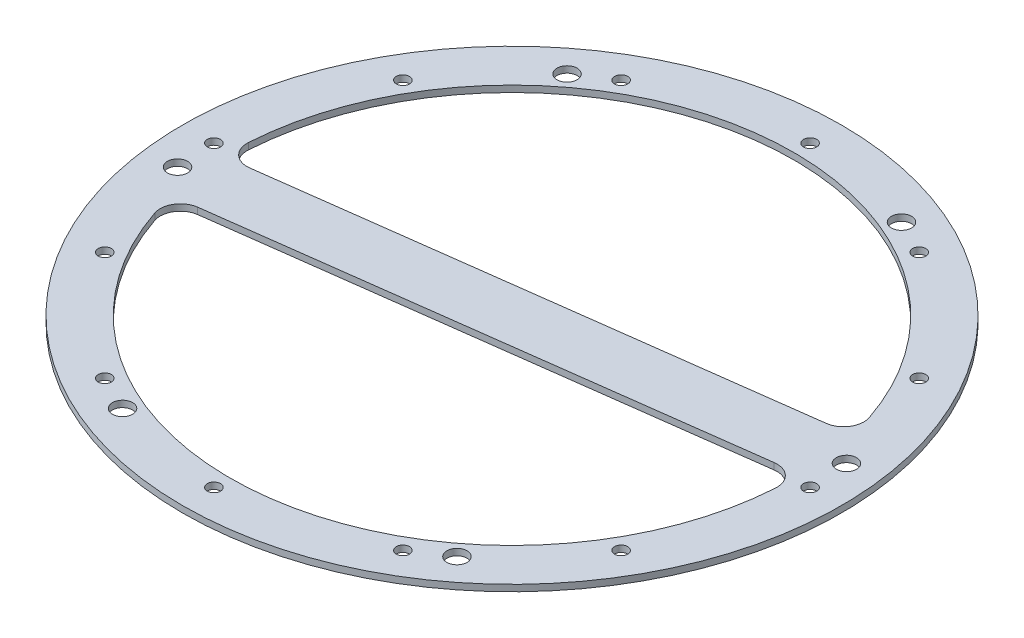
ISO-10303-21;
HEADER;
FILE_DESCRIPTION(('STEP AP214'),'2;1');
FILE_NAME('part.step','',(''),(''),'','','');
FILE_SCHEMA(('AUTOMOTIVE_DESIGN { 1 0 10303 214 1 1 1 1 }'));
ENDSEC;
DATA;
#1=APPLICATION_CONTEXT('core data for automotive mechanical design processes');
#2=APPLICATION_PROTOCOL_DEFINITION('international standard','automotive_design',2000,#1);
#3=PRODUCT_CONTEXT('',#1,'mechanical');
#4=PRODUCT('Part','Part','',(#3));
#5=PRODUCT_RELATED_PRODUCT_CATEGORY('part','',(#4));
#6=PRODUCT_DEFINITION_FORMATION('','',#4);
#7=PRODUCT_DEFINITION_CONTEXT('part definition',#1,'design');
#8=PRODUCT_DEFINITION('design','',#6,#7);
#9=PRODUCT_DEFINITION_SHAPE('','',#8);
#10=(LENGTH_UNIT() NAMED_UNIT(*) SI_UNIT(.MILLI.,.METRE.));
#11=(NAMED_UNIT(*) PLANE_ANGLE_UNIT() SI_UNIT($,.RADIAN.));
#12=(NAMED_UNIT(*) SI_UNIT($,.STERADIAN.) SOLID_ANGLE_UNIT());
#13=UNCERTAINTY_MEASURE_WITH_UNIT(LENGTH_MEASURE(1.E-05),#10,'distance_accuracy_value','');
#14=(GEOMETRIC_REPRESENTATION_CONTEXT(3) GLOBAL_UNCERTAINTY_ASSIGNED_CONTEXT((#13)) GLOBAL_UNIT_ASSIGNED_CONTEXT((#10,
#11,#12)) REPRESENTATION_CONTEXT('',''));
#15=CARTESIAN_POINT('',(0.,0.,0.));
#16=DIRECTION('',(0.,0.,1.));
#17=DIRECTION('',(1.,0.,0.));
#18=AXIS2_PLACEMENT_3D('',#15,#16,#17);
#19=CARTESIAN_POINT('',(0.,1.6,0.));
#20=DIRECTION('',(0.,1.,0.));
#21=DIRECTION('',(0.,0.,1.));
#22=AXIS2_PLACEMENT_3D('',#19,#20,#21);
#23=PLANE('',#22);
#24=CARTESIAN_POINT('',(73.2677752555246,1.6,-9.64588560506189));
#25=DIRECTION('',(0.,1.,0.));
#26=DIRECTION('',(0.,0.,1.));
#27=AXIS2_PLACEMENT_3D('',#24,#25,#26);
#28=CIRCLE('',#27,2.5);
#29=CARTESIAN_POINT('',(73.2677752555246,1.6,-7.14588560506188));
#30=VERTEX_POINT('',#29);
#31=EDGE_CURVE('E569',#30,#30,#28,.T.);
#32=ORIENTED_EDGE('',*,*,#31,.F.);
#33=EDGE_LOOP('',(#32));
#34=FACE_BOUND('',#33,.T.);
#35=CARTESIAN_POINT('',(44.9874696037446,1.6,58.6288118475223));
#36=DIRECTION('',(0.,1.,0.));
#37=DIRECTION('',(0.,0.,1.));
#38=AXIS2_PLACEMENT_3D('',#35,#36,#37);
#39=CIRCLE('',#38,2.5);
#40=CARTESIAN_POINT('',(44.9874696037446,1.6,61.1288118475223));
#41=VERTEX_POINT('',#40);
#42=EDGE_CURVE('E564',#41,#41,#39,.T.);
#43=ORIENTED_EDGE('',*,*,#42,.F.);
#44=EDGE_LOOP('',(#43));
#45=FACE_BOUND('',#44,.T.);
#46=CARTESIAN_POINT('',(-28.28030565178,1.6,68.2746974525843));
#47=DIRECTION('',(0.,1.,0.));
#48=DIRECTION('',(0.,0.,1.));
#49=AXIS2_PLACEMENT_3D('',#46,#47,#48);
#50=CIRCLE('',#49,2.5);
#51=CARTESIAN_POINT('',(-28.28030565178,1.6,70.7746974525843));
#52=VERTEX_POINT('',#51);
#53=EDGE_CURVE('E558',#52,#52,#50,.T.);
#54=ORIENTED_EDGE('',*,*,#53,.F.);
#55=EDGE_LOOP('',(#54));
#56=FACE_BOUND('',#55,.T.);
#57=CARTESIAN_POINT('',(-73.2677752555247,1.6,9.64588560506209));
#58=DIRECTION('',(0.,1.,0.));
#59=DIRECTION('',(0.,0.,1.));
#60=AXIS2_PLACEMENT_3D('',#57,#58,#59);
#61=CIRCLE('',#60,2.5);
#62=CARTESIAN_POINT('',(-73.2677752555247,1.6,12.1458856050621));
#63=VERTEX_POINT('',#62);
#64=EDGE_CURVE('E552',#63,#63,#61,.T.);
#65=ORIENTED_EDGE('',*,*,#64,.F.);
#66=EDGE_LOOP('',(#65));
#67=FACE_BOUND('',#66,.T.);
#68=CARTESIAN_POINT('',(-44.9874696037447,1.6,-58.6288118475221));
#69=DIRECTION('',(0.,1.,0.));
#70=DIRECTION('',(0.,0.,1.));
#71=AXIS2_PLACEMENT_3D('',#68,#69,#70);
#72=CIRCLE('',#71,2.5);
#73=CARTESIAN_POINT('',(-44.9874696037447,1.6,-56.1288118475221));
#74=VERTEX_POINT('',#73);
#75=EDGE_CURVE('E546',#74,#74,#72,.T.);
#76=ORIENTED_EDGE('',*,*,#75,.F.);
#77=EDGE_LOOP('',(#76));
#78=FACE_BOUND('',#77,.T.);
#79=CARTESIAN_POINT('',(28.28030565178,1.6,-68.2746974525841));
#80=DIRECTION('',(0.,1.,0.));
#81=DIRECTION('',(0.,0.,1.));
#82=AXIS2_PLACEMENT_3D('',#79,#80,#81);
#83=CIRCLE('',#82,2.5);
#84=CARTESIAN_POINT('',(28.28030565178,1.6,-65.7746974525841));
#85=VERTEX_POINT('',#84);
#86=EDGE_CURVE('E540',#85,#85,#83,.T.);
#87=ORIENTED_EDGE('',*,*,#86,.F.);
#88=EDGE_LOOP('',(#87));
#89=FACE_BOUND('',#88,.T.);
#90=CARTESIAN_POINT('',(73.9,1.6,0.));
#91=DIRECTION('',(0.,1.,0.));
#92=DIRECTION('',(0.,0.,1.));
#93=AXIS2_PLACEMENT_3D('',#90,#91,#92);
#94=CIRCLE('',#93,1.63194999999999);
#95=CARTESIAN_POINT('',(73.9,1.6,1.63194999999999));
#96=VERTEX_POINT('',#95);
#97=EDGE_CURVE('E534',#96,#96,#94,.T.);
#98=ORIENTED_EDGE('',*,*,#97,.F.);
#99=EDGE_LOOP('',(#98));
#100=FACE_BOUND('',#99,.T.);
#101=CARTESIAN_POINT('',(63.99927733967,1.6,36.95));
#102=DIRECTION('',(0.,1.,0.));
#103=DIRECTION('',(0.,0.,1.));
#104=AXIS2_PLACEMENT_3D('',#101,#102,#103);
#105=CIRCLE('',#104,1.63194999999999);
#106=CARTESIAN_POINT('',(63.99927733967,1.6,38.58195));
#107=VERTEX_POINT('',#106);
#108=EDGE_CURVE('E528',#107,#107,#105,.T.);
#109=ORIENTED_EDGE('',*,*,#108,.F.);
#110=EDGE_LOOP('',(#109));
#111=FACE_BOUND('',#110,.T.);
#112=CARTESIAN_POINT('',(36.9499999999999,1.6,63.9992773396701));
#113=DIRECTION('',(0.,1.,0.));
#114=DIRECTION('',(0.,0.,1.));
#115=AXIS2_PLACEMENT_3D('',#112,#113,#114);
#116=CIRCLE('',#115,1.63194999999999);
#117=CARTESIAN_POINT('',(36.9499999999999,1.6,65.6312273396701));
#118=VERTEX_POINT('',#117);
#119=EDGE_CURVE('E522',#118,#118,#116,.T.);
#120=ORIENTED_EDGE('',*,*,#119,.F.);
#121=EDGE_LOOP('',(#120));
#122=FACE_BOUND('',#121,.T.);
#123=CARTESIAN_POINT('',(-2.58020470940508E-13,1.6,73.9));
#124=DIRECTION('',(0.,1.,0.));
#125=DIRECTION('',(0.,0.,1.));
#126=AXIS2_PLACEMENT_3D('',#123,#124,#125);
#127=CIRCLE('',#126,1.63195);
#128=CARTESIAN_POINT('',(-2.58020470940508E-13,1.6,75.53195));
#129=VERTEX_POINT('',#128);
#130=EDGE_CURVE('E516',#129,#129,#127,.T.);
#131=ORIENTED_EDGE('',*,*,#130,.F.);
#132=EDGE_LOOP('',(#131));
#133=FACE_BOUND('',#132,.T.);
#134=CARTESIAN_POINT('',(-36.9500000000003,1.6,63.9992773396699));
#135=DIRECTION('',(0.,1.,0.));
#136=DIRECTION('',(0.,0.,1.));
#137=AXIS2_PLACEMENT_3D('',#134,#135,#136);
#138=CIRCLE('',#137,1.63195);
#139=CARTESIAN_POINT('',(-36.9500000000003,1.6,65.6312273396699));
#140=VERTEX_POINT('',#139);
#141=EDGE_CURVE('E510',#140,#140,#138,.T.);
#142=ORIENTED_EDGE('',*,*,#141,.F.);
#143=EDGE_LOOP('',(#142));
#144=FACE_BOUND('',#143,.T.);
#145=CARTESIAN_POINT('',(-63.9992773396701,1.6,36.95));
#146=DIRECTION('',(0.,1.,0.));
#147=DIRECTION('',(0.,0.,1.));
#148=AXIS2_PLACEMENT_3D('',#145,#146,#147);
#149=CIRCLE('',#148,1.63194999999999);
#150=CARTESIAN_POINT('',(-63.9992773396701,1.6,38.58195));
#151=VERTEX_POINT('',#150);
#152=EDGE_CURVE('E504',#151,#151,#149,.T.);
#153=ORIENTED_EDGE('',*,*,#152,.F.);
#154=EDGE_LOOP('',(#153));
#155=FACE_BOUND('',#154,.T.);
#156=CARTESIAN_POINT('',(-73.9,1.6,-5.16040941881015E-13));
#157=DIRECTION('',(0.,1.,0.));
#158=DIRECTION('',(0.,0.,1.));
#159=AXIS2_PLACEMENT_3D('',#156,#157,#158);
#160=CIRCLE('',#159,1.63194999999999);
#161=CARTESIAN_POINT('',(-73.9,1.6,1.63194999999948));
#162=VERTEX_POINT('',#161);
#163=EDGE_CURVE('E498',#162,#162,#160,.T.);
#164=ORIENTED_EDGE('',*,*,#163,.F.);
#165=EDGE_LOOP('',(#164));
#166=FACE_BOUND('',#165,.T.);
#167=CARTESIAN_POINT('',(-63.9992773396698,1.6,-36.9500000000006));
#168=DIRECTION('',(0.,1.,0.));
#169=DIRECTION('',(0.,0.,1.));
#170=AXIS2_PLACEMENT_3D('',#167,#168,#169);
#171=CIRCLE('',#170,1.63194999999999);
#172=CARTESIAN_POINT('',(-63.9992773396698,1.6,-35.3180500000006));
#173=VERTEX_POINT('',#172);
#174=EDGE_CURVE('E492',#173,#173,#171,.T.);
#175=ORIENTED_EDGE('',*,*,#174,.F.);
#176=EDGE_LOOP('',(#175));
#177=FACE_BOUND('',#176,.T.);
#178=CARTESIAN_POINT('',(-36.9499999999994,1.6,-63.9992773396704));
#179=DIRECTION('',(0.,1.,0.));
#180=DIRECTION('',(0.,0.,1.));
#181=AXIS2_PLACEMENT_3D('',#178,#179,#180);
#182=CIRCLE('',#181,1.63195);
#183=CARTESIAN_POINT('',(-36.9499999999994,1.6,-62.3673273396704));
#184=VERTEX_POINT('',#183);
#185=EDGE_CURVE('E486',#184,#184,#182,.T.);
#186=ORIENTED_EDGE('',*,*,#185,.F.);
#187=EDGE_LOOP('',(#186));
#188=FACE_BOUND('',#187,.T.);
#189=CARTESIAN_POINT('',(7.74061412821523E-13,1.6,-73.9));
#190=DIRECTION('',(0.,1.,0.));
#191=DIRECTION('',(0.,0.,1.));
#192=AXIS2_PLACEMENT_3D('',#189,#190,#191);
#193=CIRCLE('',#192,1.63195);
#194=CARTESIAN_POINT('',(7.74061412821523E-13,1.6,-72.26805));
#195=VERTEX_POINT('',#194);
#196=EDGE_CURVE('E480',#195,#195,#193,.T.);
#197=ORIENTED_EDGE('',*,*,#196,.F.);
#198=EDGE_LOOP('',(#197));
#199=FACE_BOUND('',#198,.T.);
#200=CARTESIAN_POINT('',(36.9500000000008,1.6,-63.9992773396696));
#201=DIRECTION('',(0.,1.,0.));
#202=DIRECTION('',(0.,0.,1.));
#203=AXIS2_PLACEMENT_3D('',#200,#201,#202);
#204=CIRCLE('',#203,1.63195);
#205=CARTESIAN_POINT('',(36.9500000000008,1.6,-62.3673273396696));
#206=VERTEX_POINT('',#205);
#207=EDGE_CURVE('E472',#206,#206,#204,.T.);
#208=ORIENTED_EDGE('',*,*,#207,.F.);
#209=EDGE_LOOP('',(#208));
#210=FACE_BOUND('',#209,.T.);
#211=CARTESIAN_POINT('',(63.99927733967,1.6,-36.95));
#212=DIRECTION('',(0.,1.,0.));
#213=DIRECTION('',(0.,0.,1.));
#214=AXIS2_PLACEMENT_3D('',#211,#212,#213);
#215=CIRCLE('',#214,1.63194999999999);
#216=CARTESIAN_POINT('',(63.99927733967,1.6,-35.31805));
#217=VERTEX_POINT('',#216);
#218=EDGE_CURVE('E467',#217,#217,#215,.T.);
#219=ORIENTED_EDGE('',*,*,#218,.F.);
#220=EDGE_LOOP('',(#219));
#221=FACE_BOUND('',#220,.T.);
#222=CARTESIAN_POINT('',(0.,1.6,0.));
#223=DIRECTION('',(0.,1.,0.));
#224=DIRECTION('',(0.,0.,1.));
#225=AXIS2_PLACEMENT_3D('',#222,#223,#224);
#226=CIRCLE('',#225,81.7);
#227=CARTESIAN_POINT('',(0.,1.6,81.7));
#228=VERTEX_POINT('',#227);
#229=EDGE_CURVE('E121',#228,#228,#226,.T.);
#230=ORIENTED_EDGE('',*,*,#229,.T.);
#231=EDGE_LOOP('',(#230));
#232=FACE_BOUND('',#231,.T.);
#233=DIRECTION('',(0.99144486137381,0.,-0.130526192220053));
#234=VECTOR('',#233,1.);
#235=CARTESIAN_POINT('',(-69.8808691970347,1.6,1.63527375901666));
#236=LINE('',#235,#234);
#237=CARTESIAN_POINT('',(-64.11896279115,1.6,0.876704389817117));
#238=VERTEX_POINT('',#237);
#239=CARTESIAN_POINT('',(62.1610699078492,1.6,-15.7483773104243));
#240=VERTEX_POINT('',#239);
#241=EDGE_CURVE('E180',#238,#240,#236,.T.);
#242=ORIENTED_EDGE('',*,*,#241,.F.);
#243=CARTESIAN_POINT('',(-64.7715937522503,1.6,-4.08051991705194));
#244=DIRECTION('',(0.,1.,0.));
#245=DIRECTION('',(0.,0.,1.));
#246=AXIS2_PLACEMENT_3D('',#243,#244,#245);
#247=CIRCLE('',#246,5.);
#248=CARTESIAN_POINT('',(-69.7617011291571,1.6,-4.39488971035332));
#249=VERTEX_POINT('',#248);
#250=EDGE_CURVE('E11',#238,#249,#247,.F.);
#251=ORIENTED_EDGE('',*,*,#250,.T.);
#252=CARTESIAN_POINT('',(0.,1.6,0.));
#253=DIRECTION('',(0.,1.,0.));
#254=DIRECTION('',(0.,0.,-1.));
#255=AXIS2_PLACEMENT_3D('',#252,#253,#254);
#256=CIRCLE('',#255,69.9);
#257=CARTESIAN_POINT('',(66.2471476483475,1.6,-22.3007943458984));
#258=VERTEX_POINT('',#257);
#259=EDGE_CURVE('E118',#258,#249,#256,.T.);
#260=ORIENTED_EDGE('',*,*,#259,.F.);
#261=CARTESIAN_POINT('',(61.5084389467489,1.6,-20.7056016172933));
#262=DIRECTION('',(0.,1.,0.));
#263=DIRECTION('',(0.,0.,1.));
#264=AXIS2_PLACEMENT_3D('',#261,#262,#263);
#265=CIRCLE('',#264,5.);
#266=EDGE_CURVE('E144',#258,#240,#265,.F.);
#267=ORIENTED_EDGE('',*,*,#266,.T.);
#268=EDGE_LOOP('',(#242,#251,#260,#267));
#269=FACE_BOUND('',#268,.T.);
#270=DIRECTION('',(-0.99144486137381,0.,0.130526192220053));
#271=VECTOR('',#270,1.);
#272=CARTESIAN_POINT('',(-67.9229763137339,1.6,16.5069466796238));
#273=LINE('',#272,#271);
#274=CARTESIAN_POINT('',(64.11896279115,1.6,-0.876704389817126));
#275=VERTEX_POINT('',#274);
#276=CARTESIAN_POINT('',(-62.1610699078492,1.6,15.7483773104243));
#277=VERTEX_POINT('',#276);
#278=EDGE_CURVE('E169',#275,#277,#273,.T.);
#279=ORIENTED_EDGE('',*,*,#278,.F.);
#280=CARTESIAN_POINT('',(64.7715937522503,1.6,4.08051991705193));
#281=DIRECTION('',(0.,1.,0.));
#282=DIRECTION('',(0.,0.,1.));
#283=AXIS2_PLACEMENT_3D('',#280,#281,#282);
#284=CIRCLE('',#283,5.);
#285=CARTESIAN_POINT('',(69.7617011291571,1.6,4.39488971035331));
#286=VERTEX_POINT('',#285);
#287=EDGE_CURVE('E148',#275,#286,#284,.F.);
#288=ORIENTED_EDGE('',*,*,#287,.T.);
#289=CARTESIAN_POINT('',(0.,1.6,0.));
#290=DIRECTION('',(0.,1.,0.));
#291=DIRECTION('',(0.,0.,1.));
#292=AXIS2_PLACEMENT_3D('',#289,#290,#291);
#293=CIRCLE('',#292,69.9);
#294=CARTESIAN_POINT('',(-66.2471476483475,1.6,22.3007943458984));
#295=VERTEX_POINT('',#294);
#296=EDGE_CURVE('E171',#295,#286,#293,.T.);
#297=ORIENTED_EDGE('',*,*,#296,.F.);
#298=CARTESIAN_POINT('',(-61.508438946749,1.6,20.7056016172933));
#299=DIRECTION('',(0.,1.,0.));
#300=DIRECTION('',(0.,0.,1.));
#301=AXIS2_PLACEMENT_3D('',#298,#299,#300);
#302=CIRCLE('',#301,5.);
#303=EDGE_CURVE('E49',#295,#277,#302,.F.);
#304=ORIENTED_EDGE('',*,*,#303,.T.);
#305=EDGE_LOOP('',(#279,#288,#297,#304));
#306=FACE_BOUND('',#305,.T.);
#307=ADVANCED_FACE('F34',(#34,#45,#56,#67,#78,#89,#100,#111,#122,#133,#144,#155,#166,#177,#188,
#199,#210,#221,#232,#269,#306),#23,.T.);
#308=CARTESIAN_POINT('',(0.,0.,0.));
#309=DIRECTION('',(0.,1.,0.));
#310=DIRECTION('',(0.,0.,1.));
#311=AXIS2_PLACEMENT_3D('',#308,#309,#310);
#312=PLANE('',#311);
#313=CARTESIAN_POINT('',(73.2677752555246,0.,-9.64588560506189));
#314=DIRECTION('',(0.,1.,0.));
#315=DIRECTION('',(0.,0.,1.));
#316=AXIS2_PLACEMENT_3D('',#313,#314,#315);
#317=CIRCLE('',#316,2.5);
#318=CARTESIAN_POINT('',(73.2677752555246,0.,-7.14588560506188));
#319=VERTEX_POINT('',#318);
#320=EDGE_CURVE('E567',#319,#319,#317,.T.);
#321=ORIENTED_EDGE('',*,*,#320,.T.);
#322=EDGE_LOOP('',(#321));
#323=FACE_BOUND('',#322,.T.);
#324=CARTESIAN_POINT('',(44.9874696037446,0.,58.6288118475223));
#325=DIRECTION('',(0.,1.,0.));
#326=DIRECTION('',(0.,0.,1.));
#327=AXIS2_PLACEMENT_3D('',#324,#325,#326);
#328=CIRCLE('',#327,2.5);
#329=CARTESIAN_POINT('',(44.9874696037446,0.,61.1288118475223));
#330=VERTEX_POINT('',#329);
#331=EDGE_CURVE('E561',#330,#330,#328,.T.);
#332=ORIENTED_EDGE('',*,*,#331,.T.);
#333=EDGE_LOOP('',(#332));
#334=FACE_BOUND('',#333,.T.);
#335=CARTESIAN_POINT('',(-28.28030565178,0.,68.2746974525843));
#336=DIRECTION('',(0.,1.,0.));
#337=DIRECTION('',(0.,0.,1.));
#338=AXIS2_PLACEMENT_3D('',#335,#336,#337);
#339=CIRCLE('',#338,2.5);
#340=CARTESIAN_POINT('',(-28.28030565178,0.,70.7746974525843));
#341=VERTEX_POINT('',#340);
#342=EDGE_CURVE('E555',#341,#341,#339,.T.);
#343=ORIENTED_EDGE('',*,*,#342,.T.);
#344=EDGE_LOOP('',(#343));
#345=FACE_BOUND('',#344,.T.);
#346=CARTESIAN_POINT('',(-73.2677752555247,0.,9.64588560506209));
#347=DIRECTION('',(0.,1.,0.));
#348=DIRECTION('',(0.,0.,1.));
#349=AXIS2_PLACEMENT_3D('',#346,#347,#348);
#350=CIRCLE('',#349,2.5);
#351=CARTESIAN_POINT('',(-73.2677752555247,0.,12.1458856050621));
#352=VERTEX_POINT('',#351);
#353=EDGE_CURVE('E549',#352,#352,#350,.T.);
#354=ORIENTED_EDGE('',*,*,#353,.T.);
#355=EDGE_LOOP('',(#354));
#356=FACE_BOUND('',#355,.T.);
#357=CARTESIAN_POINT('',(-44.9874696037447,0.,-58.6288118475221));
#358=DIRECTION('',(0.,1.,0.));
#359=DIRECTION('',(0.,0.,1.));
#360=AXIS2_PLACEMENT_3D('',#357,#358,#359);
#361=CIRCLE('',#360,2.5);
#362=CARTESIAN_POINT('',(-44.9874696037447,0.,-56.1288118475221));
#363=VERTEX_POINT('',#362);
#364=EDGE_CURVE('E543',#363,#363,#361,.T.);
#365=ORIENTED_EDGE('',*,*,#364,.T.);
#366=EDGE_LOOP('',(#365));
#367=FACE_BOUND('',#366,.T.);
#368=CARTESIAN_POINT('',(28.28030565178,0.,-68.2746974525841));
#369=DIRECTION('',(0.,1.,0.));
#370=DIRECTION('',(0.,0.,1.));
#371=AXIS2_PLACEMENT_3D('',#368,#369,#370);
#372=CIRCLE('',#371,2.5);
#373=CARTESIAN_POINT('',(28.28030565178,0.,-65.7746974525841));
#374=VERTEX_POINT('',#373);
#375=EDGE_CURVE('E537',#374,#374,#372,.T.);
#376=ORIENTED_EDGE('',*,*,#375,.T.);
#377=EDGE_LOOP('',(#376));
#378=FACE_BOUND('',#377,.T.);
#379=CARTESIAN_POINT('',(73.9,0.,0.));
#380=DIRECTION('',(0.,1.,0.));
#381=DIRECTION('',(0.,0.,1.));
#382=AXIS2_PLACEMENT_3D('',#379,#380,#381);
#383=CIRCLE('',#382,1.63194999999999);
#384=CARTESIAN_POINT('',(73.9,0.,1.63194999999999));
#385=VERTEX_POINT('',#384);
#386=EDGE_CURVE('E531',#385,#385,#383,.T.);
#387=ORIENTED_EDGE('',*,*,#386,.T.);
#388=EDGE_LOOP('',(#387));
#389=FACE_BOUND('',#388,.T.);
#390=CARTESIAN_POINT('',(63.99927733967,0.,36.95));
#391=DIRECTION('',(0.,1.,0.));
#392=DIRECTION('',(0.,0.,1.));
#393=AXIS2_PLACEMENT_3D('',#390,#391,#392);
#394=CIRCLE('',#393,1.63194999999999);
#395=CARTESIAN_POINT('',(63.99927733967,0.,38.58195));
#396=VERTEX_POINT('',#395);
#397=EDGE_CURVE('E525',#396,#396,#394,.T.);
#398=ORIENTED_EDGE('',*,*,#397,.T.);
#399=EDGE_LOOP('',(#398));
#400=FACE_BOUND('',#399,.T.);
#401=CARTESIAN_POINT('',(36.9499999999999,0.,63.9992773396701));
#402=DIRECTION('',(0.,1.,0.));
#403=DIRECTION('',(0.,0.,1.));
#404=AXIS2_PLACEMENT_3D('',#401,#402,#403);
#405=CIRCLE('',#404,1.63194999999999);
#406=CARTESIAN_POINT('',(36.9499999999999,0.,65.6312273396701));
#407=VERTEX_POINT('',#406);
#408=EDGE_CURVE('E519',#407,#407,#405,.T.);
#409=ORIENTED_EDGE('',*,*,#408,.T.);
#410=EDGE_LOOP('',(#409));
#411=FACE_BOUND('',#410,.T.);
#412=CARTESIAN_POINT('',(-2.58020470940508E-13,0.,73.9));
#413=DIRECTION('',(0.,1.,0.));
#414=DIRECTION('',(0.,0.,1.));
#415=AXIS2_PLACEMENT_3D('',#412,#413,#414);
#416=CIRCLE('',#415,1.63195);
#417=CARTESIAN_POINT('',(-2.58020470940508E-13,0.,75.53195));
#418=VERTEX_POINT('',#417);
#419=EDGE_CURVE('E513',#418,#418,#416,.T.);
#420=ORIENTED_EDGE('',*,*,#419,.T.);
#421=EDGE_LOOP('',(#420));
#422=FACE_BOUND('',#421,.T.);
#423=CARTESIAN_POINT('',(-36.9500000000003,0.,63.9992773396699));
#424=DIRECTION('',(0.,1.,0.));
#425=DIRECTION('',(0.,0.,1.));
#426=AXIS2_PLACEMENT_3D('',#423,#424,#425);
#427=CIRCLE('',#426,1.63195);
#428=CARTESIAN_POINT('',(-36.9500000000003,0.,65.6312273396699));
#429=VERTEX_POINT('',#428);
#430=EDGE_CURVE('E507',#429,#429,#427,.T.);
#431=ORIENTED_EDGE('',*,*,#430,.T.);
#432=EDGE_LOOP('',(#431));
#433=FACE_BOUND('',#432,.T.);
#434=CARTESIAN_POINT('',(-63.9992773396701,0.,36.95));
#435=DIRECTION('',(0.,1.,0.));
#436=DIRECTION('',(0.,0.,1.));
#437=AXIS2_PLACEMENT_3D('',#434,#435,#436);
#438=CIRCLE('',#437,1.63194999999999);
#439=CARTESIAN_POINT('',(-63.9992773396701,0.,38.58195));
#440=VERTEX_POINT('',#439);
#441=EDGE_CURVE('E501',#440,#440,#438,.T.);
#442=ORIENTED_EDGE('',*,*,#441,.T.);
#443=EDGE_LOOP('',(#442));
#444=FACE_BOUND('',#443,.T.);
#445=CARTESIAN_POINT('',(-73.9,0.,-5.16040941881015E-13));
#446=DIRECTION('',(0.,1.,0.));
#447=DIRECTION('',(0.,0.,1.));
#448=AXIS2_PLACEMENT_3D('',#445,#446,#447);
#449=CIRCLE('',#448,1.63194999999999);
#450=CARTESIAN_POINT('',(-73.9,0.,1.63194999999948));
#451=VERTEX_POINT('',#450);
#452=EDGE_CURVE('E495',#451,#451,#449,.T.);
#453=ORIENTED_EDGE('',*,*,#452,.T.);
#454=EDGE_LOOP('',(#453));
#455=FACE_BOUND('',#454,.T.);
#456=CARTESIAN_POINT('',(-63.9992773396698,0.,-36.9500000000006));
#457=DIRECTION('',(0.,1.,0.));
#458=DIRECTION('',(0.,0.,1.));
#459=AXIS2_PLACEMENT_3D('',#456,#457,#458);
#460=CIRCLE('',#459,1.63194999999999);
#461=CARTESIAN_POINT('',(-63.9992773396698,0.,-35.3180500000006));
#462=VERTEX_POINT('',#461);
#463=EDGE_CURVE('E489',#462,#462,#460,.T.);
#464=ORIENTED_EDGE('',*,*,#463,.T.);
#465=EDGE_LOOP('',(#464));
#466=FACE_BOUND('',#465,.T.);
#467=CARTESIAN_POINT('',(-36.9499999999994,0.,-63.9992773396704));
#468=DIRECTION('',(0.,1.,0.));
#469=DIRECTION('',(0.,0.,1.));
#470=AXIS2_PLACEMENT_3D('',#467,#468,#469);
#471=CIRCLE('',#470,1.63195);
#472=CARTESIAN_POINT('',(-36.9499999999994,0.,-62.3673273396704));
#473=VERTEX_POINT('',#472);
#474=EDGE_CURVE('E483',#473,#473,#471,.T.);
#475=ORIENTED_EDGE('',*,*,#474,.T.);
#476=EDGE_LOOP('',(#475));
#477=FACE_BOUND('',#476,.T.);
#478=CARTESIAN_POINT('',(7.74061412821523E-13,0.,-73.9));
#479=DIRECTION('',(0.,1.,0.));
#480=DIRECTION('',(0.,0.,1.));
#481=AXIS2_PLACEMENT_3D('',#478,#479,#480);
#482=CIRCLE('',#481,1.63195);
#483=CARTESIAN_POINT('',(7.74061412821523E-13,0.,-72.26805));
#484=VERTEX_POINT('',#483);
#485=EDGE_CURVE('E477',#484,#484,#482,.T.);
#486=ORIENTED_EDGE('',*,*,#485,.T.);
#487=EDGE_LOOP('',(#486));
#488=FACE_BOUND('',#487,.T.);
#489=CARTESIAN_POINT('',(36.9500000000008,0.,-63.9992773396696));
#490=DIRECTION('',(0.,1.,0.));
#491=DIRECTION('',(0.,0.,1.));
#492=AXIS2_PLACEMENT_3D('',#489,#490,#491);
#493=CIRCLE('',#492,1.63195);
#494=CARTESIAN_POINT('',(36.9500000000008,0.,-62.3673273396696));
#495=VERTEX_POINT('',#494);
#496=EDGE_CURVE('E469',#495,#495,#493,.T.);
#497=ORIENTED_EDGE('',*,*,#496,.T.);
#498=EDGE_LOOP('',(#497));
#499=FACE_BOUND('',#498,.T.);
#500=CARTESIAN_POINT('',(63.99927733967,0.,-36.95));
#501=DIRECTION('',(0.,1.,0.));
#502=DIRECTION('',(0.,0.,1.));
#503=AXIS2_PLACEMENT_3D('',#500,#501,#502);
#504=CIRCLE('',#503,1.63194999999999);
#505=CARTESIAN_POINT('',(63.99927733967,0.,-35.31805));
#506=VERTEX_POINT('',#505);
#507=EDGE_CURVE('E165',#506,#506,#504,.T.);
#508=ORIENTED_EDGE('',*,*,#507,.T.);
#509=EDGE_LOOP('',(#508));
#510=FACE_BOUND('',#509,.T.);
#511=DIRECTION('',(0.99144486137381,0.,-0.130526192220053));
#512=VECTOR('',#511,1.);
#513=CARTESIAN_POINT('',(-69.8808691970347,0.,1.63527375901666));
#514=LINE('',#513,#512);
#515=CARTESIAN_POINT('',(-64.11896279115,0.,0.876704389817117));
#516=VERTEX_POINT('',#515);
#517=CARTESIAN_POINT('',(62.1610699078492,0.,-15.7483773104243));
#518=VERTEX_POINT('',#517);
#519=EDGE_CURVE('E103',#516,#518,#514,.T.);
#520=ORIENTED_EDGE('',*,*,#519,.T.);
#521=CARTESIAN_POINT('',(61.5084389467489,0.,-20.7056016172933));
#522=DIRECTION('',(0.,1.,0.));
#523=DIRECTION('',(0.,0.,1.));
#524=AXIS2_PLACEMENT_3D('',#521,#522,#523);
#525=CIRCLE('',#524,5.);
#526=CARTESIAN_POINT('',(66.2471476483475,0.,-22.3007943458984));
#527=VERTEX_POINT('',#526);
#528=EDGE_CURVE('E142',#518,#527,#525,.T.);
#529=ORIENTED_EDGE('',*,*,#528,.T.);
#530=CARTESIAN_POINT('',(0.,0.,0.));
#531=DIRECTION('',(0.,1.,0.));
#532=DIRECTION('',(0.,0.,-1.));
#533=AXIS2_PLACEMENT_3D('',#530,#531,#532);
#534=CIRCLE('',#533,69.9);
#535=CARTESIAN_POINT('',(-69.7617011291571,0.,-4.39488971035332));
#536=VERTEX_POINT('',#535);
#537=EDGE_CURVE('E105',#527,#536,#534,.T.);
#538=ORIENTED_EDGE('',*,*,#537,.T.);
#539=CARTESIAN_POINT('',(-64.7715937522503,0.,-4.08051991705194));
#540=DIRECTION('',(0.,1.,0.));
#541=DIRECTION('',(0.,0.,1.));
#542=AXIS2_PLACEMENT_3D('',#539,#540,#541);
#543=CIRCLE('',#542,5.);
#544=EDGE_CURVE('E42',#536,#516,#543,.T.);
#545=ORIENTED_EDGE('',*,*,#544,.T.);
#546=EDGE_LOOP('',(#520,#529,#538,#545));
#547=FACE_BOUND('',#546,.T.);
#548=CARTESIAN_POINT('',(0.,0.,0.));
#549=DIRECTION('',(0.,1.,0.));
#550=DIRECTION('',(0.,0.,1.));
#551=AXIS2_PLACEMENT_3D('',#548,#549,#550);
#552=CIRCLE('',#551,81.7);
#553=CARTESIAN_POINT('',(0.,0.,81.7));
#554=VERTEX_POINT('',#553);
#555=EDGE_CURVE('E126',#554,#554,#552,.T.);
#556=ORIENTED_EDGE('',*,*,#555,.F.);
#557=EDGE_LOOP('',(#556));
#558=FACE_BOUND('',#557,.T.);
#559=DIRECTION('',(-0.99144486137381,0.,0.130526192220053));
#560=VECTOR('',#559,1.);
#561=CARTESIAN_POINT('',(-67.9229763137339,0.,16.5069466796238));
#562=LINE('',#561,#560);
#563=CARTESIAN_POINT('',(64.11896279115,0.,-0.876704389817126));
#564=VERTEX_POINT('',#563);
#565=CARTESIAN_POINT('',(-62.1610699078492,0.,15.7483773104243));
#566=VERTEX_POINT('',#565);
#567=EDGE_CURVE('E157',#564,#566,#562,.T.);
#568=ORIENTED_EDGE('',*,*,#567,.T.);
#569=CARTESIAN_POINT('',(-61.508438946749,0.,20.7056016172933));
#570=DIRECTION('',(0.,1.,0.));
#571=DIRECTION('',(0.,0.,1.));
#572=AXIS2_PLACEMENT_3D('',#569,#570,#571);
#573=CIRCLE('',#572,5.);
#574=CARTESIAN_POINT('',(-66.2471476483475,0.,22.3007943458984));
#575=VERTEX_POINT('',#574);
#576=EDGE_CURVE('E150',#566,#575,#573,.T.);
#577=ORIENTED_EDGE('',*,*,#576,.T.);
#578=CARTESIAN_POINT('',(0.,0.,0.));
#579=DIRECTION('',(0.,1.,0.));
#580=DIRECTION('',(0.,0.,1.));
#581=AXIS2_PLACEMENT_3D('',#578,#579,#580);
#582=CIRCLE('',#581,69.9);
#583=CARTESIAN_POINT('',(69.7617011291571,0.,4.39488971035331));
#584=VERTEX_POINT('',#583);
#585=EDGE_CURVE('E156',#575,#584,#582,.T.);
#586=ORIENTED_EDGE('',*,*,#585,.T.);
#587=CARTESIAN_POINT('',(64.7715937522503,0.,4.08051991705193));
#588=DIRECTION('',(0.,1.,0.));
#589=DIRECTION('',(0.,0.,1.));
#590=AXIS2_PLACEMENT_3D('',#587,#588,#589);
#591=CIRCLE('',#590,5.);
#592=EDGE_CURVE('E146',#584,#564,#591,.T.);
#593=ORIENTED_EDGE('',*,*,#592,.T.);
#594=EDGE_LOOP('',(#568,#577,#586,#593));
#595=FACE_BOUND('',#594,.T.);
#596=ADVANCED_FACE('F101',(#323,#334,#345,#356,#367,#378,#389,#400,#411,#422,#433,#444,#455,
#466,#477,#488,#499,#510,#547,#558,#595),#312,.F.);
#597=CARTESIAN_POINT('',(0.,1.6,0.));
#598=DIRECTION('',(0.,-1.,0.));
#599=DIRECTION('',(0.,0.,-1.));
#600=AXIS2_PLACEMENT_3D('',#597,#598,#599);
#601=CYLINDRICAL_SURFACE('',#600,81.7);
#602=ORIENTED_EDGE('',*,*,#229,.F.);
#603=EDGE_LOOP('',(#602));
#604=FACE_BOUND('',#603,.T.);
#605=ORIENTED_EDGE('',*,*,#555,.T.);
#606=EDGE_LOOP('',(#605));
#607=FACE_BOUND('',#606,.T.);
#608=ADVANCED_FACE('F184',(#604,#607),#601,.T.);
#609=CARTESIAN_POINT('',(0.,1.6,0.));
#610=DIRECTION('',(0.,-1.,0.));
#611=DIRECTION('',(0.,0.,-1.));
#612=AXIS2_PLACEMENT_3D('',#609,#610,#611);
#613=CYLINDRICAL_SURFACE('',#612,69.9);
#614=ORIENTED_EDGE('',*,*,#537,.F.);
#615=DIRECTION('',(0.,-1.,0.));
#616=VECTOR('',#615,1.);
#617=CARTESIAN_POINT('',(66.2471476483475,1.6,-22.3007943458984));
#618=LINE('',#617,#616);
#619=EDGE_CURVE('E131',#527,#258,#618,.F.);
#620=ORIENTED_EDGE('',*,*,#619,.T.);
#621=ORIENTED_EDGE('',*,*,#259,.T.);
#622=DIRECTION('',(0.,-1.,0.));
#623=VECTOR('',#622,1.);
#624=CARTESIAN_POINT('',(-69.7617011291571,1.6,-4.39488971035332));
#625=LINE('',#624,#623);
#626=EDGE_CURVE('E123',#249,#536,#625,.T.);
#627=ORIENTED_EDGE('',*,*,#626,.T.);
#628=EDGE_LOOP('',(#614,#620,#621,#627));
#629=FACE_BOUND('',#628,.T.);
#630=ADVANCED_FACE('F192',(#629),#613,.F.);
#631=CARTESIAN_POINT('',(-69.8808691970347,1.6,1.63527375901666));
#632=DIRECTION('',(-0.130526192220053,0.,-0.99144486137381));
#633=DIRECTION('',(-0.99144486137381,0.,0.130526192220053));
#634=AXIS2_PLACEMENT_3D('',#631,#632,#633);
#635=PLANE('',#634);
#636=ORIENTED_EDGE('',*,*,#241,.T.);
#637=DIRECTION('',(0.,1.,0.));
#638=VECTOR('',#637,1.);
#639=CARTESIAN_POINT('',(62.1610699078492,0.,-15.7483773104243));
#640=LINE('',#639,#638);
#641=EDGE_CURVE('E117',#240,#518,#640,.F.);
#642=ORIENTED_EDGE('',*,*,#641,.T.);
#643=ORIENTED_EDGE('',*,*,#519,.F.);
#644=DIRECTION('',(0.,1.,0.));
#645=VECTOR('',#644,1.);
#646=CARTESIAN_POINT('',(-64.11896279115,1.6,0.876704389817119));
#647=LINE('',#646,#645);
#648=EDGE_CURVE('E114',#516,#238,#647,.T.);
#649=ORIENTED_EDGE('',*,*,#648,.T.);
#650=EDGE_LOOP('',(#636,#642,#643,#649));
#651=FACE_BOUND('',#650,.T.);
#652=ADVANCED_FACE('F113',(#651),#635,.T.);
#653=CARTESIAN_POINT('',(0.,1.6,0.));
#654=DIRECTION('',(0.,-1.,0.));
#655=DIRECTION('',(0.,0.,-1.));
#656=AXIS2_PLACEMENT_3D('',#653,#654,#655);
#657=CYLINDRICAL_SURFACE('',#656,69.9);
#658=ORIENTED_EDGE('',*,*,#296,.T.);
#659=DIRECTION('',(0.,-1.,0.));
#660=VECTOR('',#659,1.);
#661=CARTESIAN_POINT('',(69.7617011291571,1.6,4.39488971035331));
#662=LINE('',#661,#660);
#663=EDGE_CURVE('E135',#286,#584,#662,.T.);
#664=ORIENTED_EDGE('',*,*,#663,.T.);
#665=ORIENTED_EDGE('',*,*,#585,.F.);
#666=DIRECTION('',(0.,-1.,0.));
#667=VECTOR('',#666,1.);
#668=CARTESIAN_POINT('',(-66.2471476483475,1.6,22.3007943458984));
#669=LINE('',#668,#667);
#670=EDGE_CURVE('E133',#575,#295,#669,.F.);
#671=ORIENTED_EDGE('',*,*,#670,.T.);
#672=EDGE_LOOP('',(#658,#664,#665,#671));
#673=FACE_BOUND('',#672,.T.);
#674=ADVANCED_FACE('F163',(#673),#657,.F.);
#675=CARTESIAN_POINT('',(-67.9229763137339,1.6,16.5069466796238));
#676=DIRECTION('',(0.130526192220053,0.,0.99144486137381));
#677=DIRECTION('',(0.99144486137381,0.,-0.130526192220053));
#678=AXIS2_PLACEMENT_3D('',#675,#676,#677);
#679=PLANE('',#678);
#680=ORIENTED_EDGE('',*,*,#567,.F.);
#681=DIRECTION('',(0.,1.,0.));
#682=VECTOR('',#681,1.);
#683=CARTESIAN_POINT('',(64.11896279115,1.6,-0.876704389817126));
#684=LINE('',#683,#682);
#685=EDGE_CURVE('E56',#564,#275,#684,.T.);
#686=ORIENTED_EDGE('',*,*,#685,.T.);
#687=ORIENTED_EDGE('',*,*,#278,.T.);
#688=DIRECTION('',(0.,1.,0.));
#689=VECTOR('',#688,1.);
#690=CARTESIAN_POINT('',(-62.1610699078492,0.,15.7483773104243));
#691=LINE('',#690,#689);
#692=EDGE_CURVE('E138',#277,#566,#691,.F.);
#693=ORIENTED_EDGE('',*,*,#692,.T.);
#694=EDGE_LOOP('',(#680,#686,#687,#693));
#695=FACE_BOUND('',#694,.T.);
#696=ADVANCED_FACE('F168',(#695),#679,.T.);
#697=CARTESIAN_POINT('',(63.99927733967,1.6,-36.95));
#698=DIRECTION('',(0.,1.,0.));
#699=DIRECTION('',(0.,0.,1.));
#700=AXIS2_PLACEMENT_3D('',#697,#698,#699);
#701=CYLINDRICAL_SURFACE('',#700,1.63194999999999);
#702=ORIENTED_EDGE('',*,*,#507,.F.);
#703=EDGE_LOOP('',(#702));
#704=FACE_BOUND('',#703,.T.);
#705=ORIENTED_EDGE('',*,*,#218,.T.);
#706=EDGE_LOOP('',(#705));
#707=FACE_BOUND('',#706,.T.);
#708=ADVANCED_FACE('F242',(#704,#707),#701,.F.);
#709=CARTESIAN_POINT('',(36.9500000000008,1.6,-63.9992773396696));
#710=DIRECTION('',(0.,1.,0.));
#711=DIRECTION('',(0.,0.,1.));
#712=AXIS2_PLACEMENT_3D('',#709,#710,#711);
#713=CYLINDRICAL_SURFACE('',#712,1.63195);
#714=ORIENTED_EDGE('',*,*,#496,.F.);
#715=EDGE_LOOP('',(#714));
#716=FACE_BOUND('',#715,.T.);
#717=ORIENTED_EDGE('',*,*,#207,.T.);
#718=EDGE_LOOP('',(#717));
#719=FACE_BOUND('',#718,.T.);
#720=ADVANCED_FACE('F436',(#716,#719),#713,.F.);
#721=CARTESIAN_POINT('',(7.74061412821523E-13,1.6,-73.9));
#722=DIRECTION('',(0.,1.,0.));
#723=DIRECTION('',(0.,0.,1.));
#724=AXIS2_PLACEMENT_3D('',#721,#722,#723);
#725=CYLINDRICAL_SURFACE('',#724,1.63195);
#726=ORIENTED_EDGE('',*,*,#485,.F.);
#727=EDGE_LOOP('',(#726));
#728=FACE_BOUND('',#727,.T.);
#729=ORIENTED_EDGE('',*,*,#196,.T.);
#730=EDGE_LOOP('',(#729));
#731=FACE_BOUND('',#730,.T.);
#732=ADVANCED_FACE('F426',(#728,#731),#725,.F.);
#733=CARTESIAN_POINT('',(-36.9499999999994,1.6,-63.9992773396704));
#734=DIRECTION('',(0.,1.,0.));
#735=DIRECTION('',(0.,0.,1.));
#736=AXIS2_PLACEMENT_3D('',#733,#734,#735);
#737=CYLINDRICAL_SURFACE('',#736,1.63195);
#738=ORIENTED_EDGE('',*,*,#474,.F.);
#739=EDGE_LOOP('',(#738));
#740=FACE_BOUND('',#739,.T.);
#741=ORIENTED_EDGE('',*,*,#185,.T.);
#742=EDGE_LOOP('',(#741));
#743=FACE_BOUND('',#742,.T.);
#744=ADVANCED_FACE('F416',(#740,#743),#737,.F.);
#745=CARTESIAN_POINT('',(-63.9992773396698,1.6,-36.9500000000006));
#746=DIRECTION('',(0.,1.,0.));
#747=DIRECTION('',(0.,0.,1.));
#748=AXIS2_PLACEMENT_3D('',#745,#746,#747);
#749=CYLINDRICAL_SURFACE('',#748,1.63194999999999);
#750=ORIENTED_EDGE('',*,*,#463,.F.);
#751=EDGE_LOOP('',(#750));
#752=FACE_BOUND('',#751,.T.);
#753=ORIENTED_EDGE('',*,*,#174,.T.);
#754=EDGE_LOOP('',(#753));
#755=FACE_BOUND('',#754,.T.);
#756=ADVANCED_FACE('F406',(#752,#755),#749,.F.);
#757=CARTESIAN_POINT('',(-73.9,1.6,-5.16040941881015E-13));
#758=DIRECTION('',(0.,1.,0.));
#759=DIRECTION('',(0.,0.,1.));
#760=AXIS2_PLACEMENT_3D('',#757,#758,#759);
#761=CYLINDRICAL_SURFACE('',#760,1.63194999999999);
#762=ORIENTED_EDGE('',*,*,#452,.F.);
#763=EDGE_LOOP('',(#762));
#764=FACE_BOUND('',#763,.T.);
#765=ORIENTED_EDGE('',*,*,#163,.T.);
#766=EDGE_LOOP('',(#765));
#767=FACE_BOUND('',#766,.T.);
#768=ADVANCED_FACE('F396',(#764,#767),#761,.F.);
#769=CARTESIAN_POINT('',(-63.9992773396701,1.6,36.95));
#770=DIRECTION('',(0.,1.,0.));
#771=DIRECTION('',(0.,0.,1.));
#772=AXIS2_PLACEMENT_3D('',#769,#770,#771);
#773=CYLINDRICAL_SURFACE('',#772,1.63194999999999);
#774=ORIENTED_EDGE('',*,*,#441,.F.);
#775=EDGE_LOOP('',(#774));
#776=FACE_BOUND('',#775,.T.);
#777=ORIENTED_EDGE('',*,*,#152,.T.);
#778=EDGE_LOOP('',(#777));
#779=FACE_BOUND('',#778,.T.);
#780=ADVANCED_FACE('F386',(#776,#779),#773,.F.);
#781=CARTESIAN_POINT('',(-36.9500000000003,1.6,63.9992773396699));
#782=DIRECTION('',(0.,1.,0.));
#783=DIRECTION('',(0.,0.,1.));
#784=AXIS2_PLACEMENT_3D('',#781,#782,#783);
#785=CYLINDRICAL_SURFACE('',#784,1.63195);
#786=ORIENTED_EDGE('',*,*,#430,.F.);
#787=EDGE_LOOP('',(#786));
#788=FACE_BOUND('',#787,.T.);
#789=ORIENTED_EDGE('',*,*,#141,.T.);
#790=EDGE_LOOP('',(#789));
#791=FACE_BOUND('',#790,.T.);
#792=ADVANCED_FACE('F376',(#788,#791),#785,.F.);
#793=CARTESIAN_POINT('',(-2.58020470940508E-13,1.6,73.9));
#794=DIRECTION('',(0.,1.,0.));
#795=DIRECTION('',(0.,0.,1.));
#796=AXIS2_PLACEMENT_3D('',#793,#794,#795);
#797=CYLINDRICAL_SURFACE('',#796,1.63195);
#798=ORIENTED_EDGE('',*,*,#419,.F.);
#799=EDGE_LOOP('',(#798));
#800=FACE_BOUND('',#799,.T.);
#801=ORIENTED_EDGE('',*,*,#130,.T.);
#802=EDGE_LOOP('',(#801));
#803=FACE_BOUND('',#802,.T.);
#804=ADVANCED_FACE('F366',(#800,#803),#797,.F.);
#805=CARTESIAN_POINT('',(36.9499999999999,1.6,63.9992773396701));
#806=DIRECTION('',(0.,1.,0.));
#807=DIRECTION('',(0.,0.,1.));
#808=AXIS2_PLACEMENT_3D('',#805,#806,#807);
#809=CYLINDRICAL_SURFACE('',#808,1.63194999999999);
#810=ORIENTED_EDGE('',*,*,#408,.F.);
#811=EDGE_LOOP('',(#810));
#812=FACE_BOUND('',#811,.T.);
#813=ORIENTED_EDGE('',*,*,#119,.T.);
#814=EDGE_LOOP('',(#813));
#815=FACE_BOUND('',#814,.T.);
#816=ADVANCED_FACE('F356',(#812,#815),#809,.F.);
#817=CARTESIAN_POINT('',(63.99927733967,1.6,36.95));
#818=DIRECTION('',(0.,1.,0.));
#819=DIRECTION('',(0.,0.,1.));
#820=AXIS2_PLACEMENT_3D('',#817,#818,#819);
#821=CYLINDRICAL_SURFACE('',#820,1.63194999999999);
#822=ORIENTED_EDGE('',*,*,#397,.F.);
#823=EDGE_LOOP('',(#822));
#824=FACE_BOUND('',#823,.T.);
#825=ORIENTED_EDGE('',*,*,#108,.T.);
#826=EDGE_LOOP('',(#825));
#827=FACE_BOUND('',#826,.T.);
#828=ADVANCED_FACE('F346',(#824,#827),#821,.F.);
#829=CARTESIAN_POINT('',(73.9,1.6,0.));
#830=DIRECTION('',(0.,1.,0.));
#831=DIRECTION('',(0.,0.,1.));
#832=AXIS2_PLACEMENT_3D('',#829,#830,#831);
#833=CYLINDRICAL_SURFACE('',#832,1.63194999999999);
#834=ORIENTED_EDGE('',*,*,#386,.F.);
#835=EDGE_LOOP('',(#834));
#836=FACE_BOUND('',#835,.T.);
#837=ORIENTED_EDGE('',*,*,#97,.T.);
#838=EDGE_LOOP('',(#837));
#839=FACE_BOUND('',#838,.T.);
#840=ADVANCED_FACE('F336',(#836,#839),#833,.F.);
#841=CARTESIAN_POINT('',(28.28030565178,1.6,-68.2746974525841));
#842=DIRECTION('',(0.,1.,0.));
#843=DIRECTION('',(0.,0.,1.));
#844=AXIS2_PLACEMENT_3D('',#841,#842,#843);
#845=CYLINDRICAL_SURFACE('',#844,2.5);
#846=ORIENTED_EDGE('',*,*,#375,.F.);
#847=EDGE_LOOP('',(#846));
#848=FACE_BOUND('',#847,.T.);
#849=ORIENTED_EDGE('',*,*,#86,.T.);
#850=EDGE_LOOP('',(#849));
#851=FACE_BOUND('',#850,.T.);
#852=ADVANCED_FACE('F326',(#848,#851),#845,.F.);
#853=CARTESIAN_POINT('',(-44.9874696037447,1.6,-58.6288118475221));
#854=DIRECTION('',(0.,1.,0.));
#855=DIRECTION('',(0.,0.,1.));
#856=AXIS2_PLACEMENT_3D('',#853,#854,#855);
#857=CYLINDRICAL_SURFACE('',#856,2.5);
#858=ORIENTED_EDGE('',*,*,#364,.F.);
#859=EDGE_LOOP('',(#858));
#860=FACE_BOUND('',#859,.T.);
#861=ORIENTED_EDGE('',*,*,#75,.T.);
#862=EDGE_LOOP('',(#861));
#863=FACE_BOUND('',#862,.T.);
#864=ADVANCED_FACE('F316',(#860,#863),#857,.F.);
#865=CARTESIAN_POINT('',(-73.2677752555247,1.6,9.64588560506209));
#866=DIRECTION('',(0.,1.,0.));
#867=DIRECTION('',(0.,0.,1.));
#868=AXIS2_PLACEMENT_3D('',#865,#866,#867);
#869=CYLINDRICAL_SURFACE('',#868,2.5);
#870=ORIENTED_EDGE('',*,*,#353,.F.);
#871=EDGE_LOOP('',(#870));
#872=FACE_BOUND('',#871,.T.);
#873=ORIENTED_EDGE('',*,*,#64,.T.);
#874=EDGE_LOOP('',(#873));
#875=FACE_BOUND('',#874,.T.);
#876=ADVANCED_FACE('F306',(#872,#875),#869,.F.);
#877=CARTESIAN_POINT('',(-28.28030565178,1.6,68.2746974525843));
#878=DIRECTION('',(0.,1.,0.));
#879=DIRECTION('',(0.,0.,1.));
#880=AXIS2_PLACEMENT_3D('',#877,#878,#879);
#881=CYLINDRICAL_SURFACE('',#880,2.5);
#882=ORIENTED_EDGE('',*,*,#342,.F.);
#883=EDGE_LOOP('',(#882));
#884=FACE_BOUND('',#883,.T.);
#885=ORIENTED_EDGE('',*,*,#53,.T.);
#886=EDGE_LOOP('',(#885));
#887=FACE_BOUND('',#886,.T.);
#888=ADVANCED_FACE('F296',(#884,#887),#881,.F.);
#889=CARTESIAN_POINT('',(44.9874696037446,1.6,58.6288118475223));
#890=DIRECTION('',(0.,1.,0.));
#891=DIRECTION('',(0.,0.,1.));
#892=AXIS2_PLACEMENT_3D('',#889,#890,#891);
#893=CYLINDRICAL_SURFACE('',#892,2.5);
#894=ORIENTED_EDGE('',*,*,#331,.F.);
#895=EDGE_LOOP('',(#894));
#896=FACE_BOUND('',#895,.T.);
#897=ORIENTED_EDGE('',*,*,#42,.T.);
#898=EDGE_LOOP('',(#897));
#899=FACE_BOUND('',#898,.T.);
#900=ADVANCED_FACE('F286',(#896,#899),#893,.F.);
#901=CARTESIAN_POINT('',(73.2677752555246,1.6,-9.64588560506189));
#902=DIRECTION('',(0.,1.,0.));
#903=DIRECTION('',(0.,0.,1.));
#904=AXIS2_PLACEMENT_3D('',#901,#902,#903);
#905=CYLINDRICAL_SURFACE('',#904,2.5);
#906=ORIENTED_EDGE('',*,*,#320,.F.);
#907=EDGE_LOOP('',(#906));
#908=FACE_BOUND('',#907,.T.);
#909=ORIENTED_EDGE('',*,*,#31,.T.);
#910=EDGE_LOOP('',(#909));
#911=FACE_BOUND('',#910,.T.);
#912=ADVANCED_FACE('F205',(#908,#911),#905,.F.);
#913=CARTESIAN_POINT('',(61.5084389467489,1.6,-20.7056016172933));
#914=DIRECTION('',(0.,-1.,0.));
#915=DIRECTION('',(0.,0.,-1.));
#916=AXIS2_PLACEMENT_3D('',#913,#914,#915);
#917=CYLINDRICAL_SURFACE('',#916,5.);
#918=ORIENTED_EDGE('',*,*,#266,.F.);
#919=ORIENTED_EDGE('',*,*,#619,.F.);
#920=ORIENTED_EDGE('',*,*,#528,.F.);
#921=ORIENTED_EDGE('',*,*,#641,.F.);
#922=EDGE_LOOP('',(#918,#919,#920,#921));
#923=FACE_BOUND('',#922,.T.);
#924=ADVANCED_FACE('F201',(#923),#917,.F.);
#925=CARTESIAN_POINT('',(64.7715937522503,1.6,4.08051991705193));
#926=DIRECTION('',(0.,-1.,0.));
#927=DIRECTION('',(0.,0.,-1.));
#928=AXIS2_PLACEMENT_3D('',#925,#926,#927);
#929=CYLINDRICAL_SURFACE('',#928,5.);
#930=ORIENTED_EDGE('',*,*,#287,.F.);
#931=ORIENTED_EDGE('',*,*,#685,.F.);
#932=ORIENTED_EDGE('',*,*,#592,.F.);
#933=ORIENTED_EDGE('',*,*,#663,.F.);
#934=EDGE_LOOP('',(#930,#931,#932,#933));
#935=FACE_BOUND('',#934,.T.);
#936=ADVANCED_FACE('F204',(#935),#929,.F.);
#937=CARTESIAN_POINT('',(-61.508438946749,1.6,20.7056016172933));
#938=DIRECTION('',(0.,-1.,0.));
#939=DIRECTION('',(0.,0.,-1.));
#940=AXIS2_PLACEMENT_3D('',#937,#938,#939);
#941=CYLINDRICAL_SURFACE('',#940,5.);
#942=ORIENTED_EDGE('',*,*,#303,.F.);
#943=ORIENTED_EDGE('',*,*,#670,.F.);
#944=ORIENTED_EDGE('',*,*,#576,.F.);
#945=ORIENTED_EDGE('',*,*,#692,.F.);
#946=EDGE_LOOP('',(#942,#943,#944,#945));
#947=FACE_BOUND('',#946,.T.);
#948=ADVANCED_FACE('F167',(#947),#941,.F.);
#949=CARTESIAN_POINT('',(-64.7715937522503,1.6,-4.08051991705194));
#950=DIRECTION('',(0.,-1.,0.));
#951=DIRECTION('',(0.,0.,-1.));
#952=AXIS2_PLACEMENT_3D('',#949,#950,#951);
#953=CYLINDRICAL_SURFACE('',#952,5.);
#954=ORIENTED_EDGE('',*,*,#250,.F.);
#955=ORIENTED_EDGE('',*,*,#648,.F.);
#956=ORIENTED_EDGE('',*,*,#544,.F.);
#957=ORIENTED_EDGE('',*,*,#626,.F.);
#958=EDGE_LOOP('',(#954,#955,#956,#957));
#959=FACE_BOUND('',#958,.T.);
#960=ADVANCED_FACE('F36',(#959),#953,.F.);
#961=CLOSED_SHELL('',(#307,#596,#608,#630,#652,#674,#696,#708,#720,#732,#744,#756,#768,#780,
#792,#804,#816,#828,#840,#852,#864,#876,#888,#900,#912,#924,#936,#948,#960));
#962=MANIFOLD_SOLID_BREP('B2',#961);
#963=ADVANCED_BREP_SHAPE_REPRESENTATION('',(#18,#962),#14);
#964=SHAPE_DEFINITION_REPRESENTATION(#9,#963);
ENDSEC;
END-ISO-10303-21;
